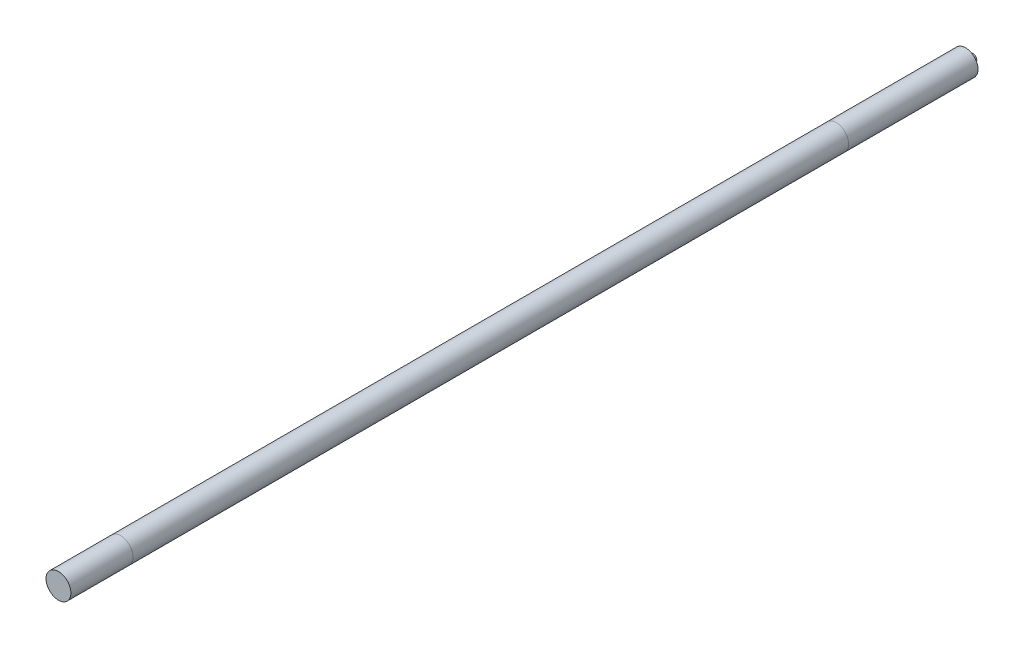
from build123d import *

# Parameters (mm, degrees)
ESQUISSE1_R             = 10
BASE_EXTRUSION_DEPTH    = 735
ESQUISSE5_OUTSIDE_W     = 169.108
ESQUISSE5_OUTSIDE_H     = 169.108
ESQUISSE5_OUTSIDE_R     = 3
ENL_V_MAT_EXTRU_1_DEPTH = 6


with BuildPart() as part:
    # Esquisse1 → Base-Extrusion (new body)
    with BuildSketch(Plane.XY):
        with Locations(Location((0, 0, 0), (0, 0, 180))):
            Circle(ESQUISSE1_R)
    extrude(amount=BASE_EXTRUSION_DEPTH)

    # Esquisse5 outside → Enl_v. mat.-Extru.1 (cut)
    with BuildSketch(Plane(origin=(0, 0, 0), x_dir=(-1, 0, 0), z_dir=(0, 0, -1))):
        Rectangle(ESQUISSE5_OUTSIDE_W, ESQUISSE5_OUTSIDE_H)
        Circle(ESQUISSE5_OUTSIDE_R, mode=Mode.SUBTRACT)
    extrude(amount=-ENL_V_MAT_EXTRU_1_DEPTH, mode=Mode.SUBTRACT)


solid = part.part
